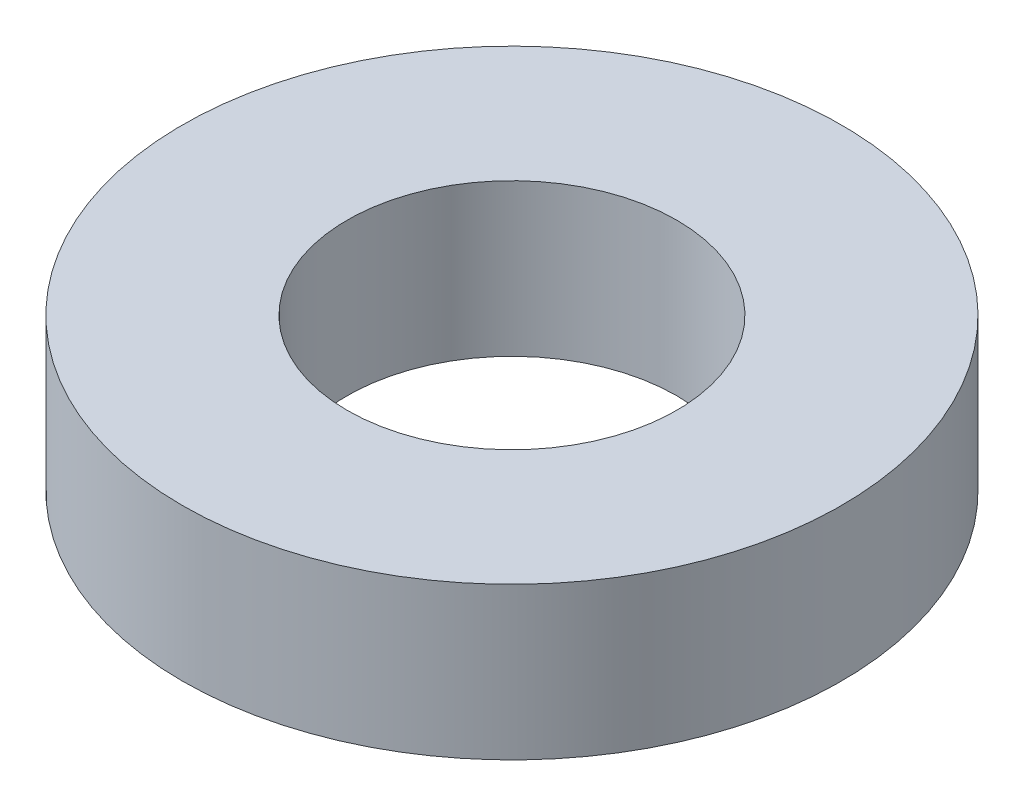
from build123d import *

# Parameters (mm, degrees)
SKETCH1_R           = 6.5
SKETCH1_R_2         = 3.25
BOSS_EXTRUDE1_DEPTH = 3


with BuildPart() as part:
    # Sketch1 → Boss-Extrude1 (new body)
    with BuildSketch(Plane(origin=(0, 0, 0), x_dir=(1, 0, 0), z_dir=(0, 1, 0))):
        with Locations(Location((0, 0, 0), (0, 0, 270))):
            Circle(SKETCH1_R)
        with Locations(Location((0, 0, 0), (0, 0, 270))):
            Circle(SKETCH1_R_2, mode=Mode.SUBTRACT)
    extrude(amount=BOSS_EXTRUDE1_DEPTH)


solid = part.part
